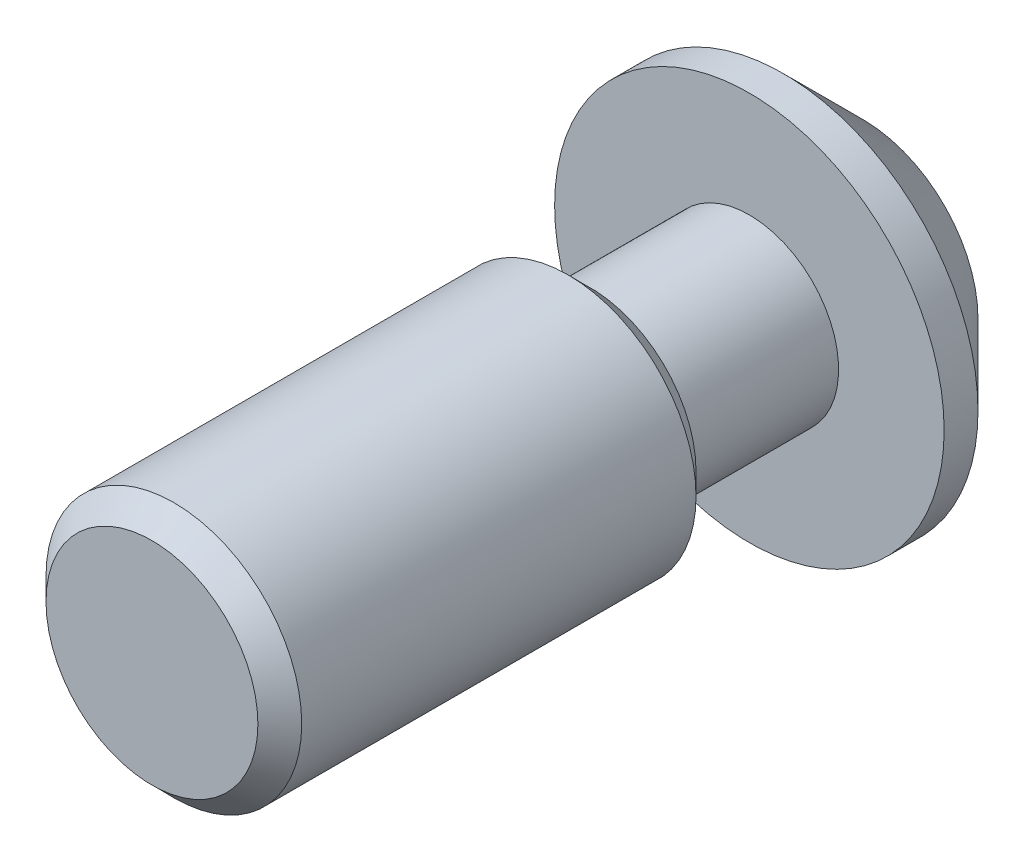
ISO-10303-21;
HEADER;
FILE_DESCRIPTION(('STEP AP214'),'2;1');
FILE_NAME('part.step','',(''),(''),'','','');
FILE_SCHEMA(('AUTOMOTIVE_DESIGN { 1 0 10303 214 1 1 1 1 }'));
ENDSEC;
DATA;
#1=APPLICATION_CONTEXT('core data for automotive mechanical design processes');
#2=APPLICATION_PROTOCOL_DEFINITION('international standard','automotive_design',2000,#1);
#3=PRODUCT_CONTEXT('',#1,'mechanical');
#4=PRODUCT('Part','Part','',(#3));
#5=PRODUCT_RELATED_PRODUCT_CATEGORY('part','',(#4));
#6=PRODUCT_DEFINITION_FORMATION('','',#4);
#7=PRODUCT_DEFINITION_CONTEXT('part definition',#1,'design');
#8=PRODUCT_DEFINITION('design','',#6,#7);
#9=PRODUCT_DEFINITION_SHAPE('','',#8);
#10=(LENGTH_UNIT() NAMED_UNIT(*) SI_UNIT(.MILLI.,.METRE.));
#11=(NAMED_UNIT(*) PLANE_ANGLE_UNIT() SI_UNIT($,.RADIAN.));
#12=(NAMED_UNIT(*) SI_UNIT($,.STERADIAN.) SOLID_ANGLE_UNIT());
#13=UNCERTAINTY_MEASURE_WITH_UNIT(LENGTH_MEASURE(1.E-05),#10,'distance_accuracy_value','');
#14=(GEOMETRIC_REPRESENTATION_CONTEXT(3) GLOBAL_UNCERTAINTY_ASSIGNED_CONTEXT((#13)) GLOBAL_UNIT_ASSIGNED_CONTEXT((#10,
#11,#12)) REPRESENTATION_CONTEXT('',''));
#15=CARTESIAN_POINT('',(0.,0.,0.));
#16=DIRECTION('',(0.,0.,1.));
#17=DIRECTION('',(1.,0.,0.));
#18=AXIS2_PLACEMENT_3D('',#15,#16,#17);
#19=CARTESIAN_POINT('',(0.,-2.88997909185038,-11.6999999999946));
#20=DIRECTION('',(0.,0.,-1.));
#21=DIRECTION('',(-1.,0.,0.));
#22=AXIS2_PLACEMENT_3D('',#19,#20,#21);
#23=PLANE('',#22);
#24=CARTESIAN_POINT('',(0.,0.,-11.7000000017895));
#25=DIRECTION('',(0.,0.,1.));
#26=DIRECTION('',(1.,0.,0.));
#27=AXIS2_PLACEMENT_3D('',#24,#25,#26);
#28=CIRCLE('',#27,5.77995818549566);
#29=CARTESIAN_POINT('',(5.77995818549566,0.,-11.7000000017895));
#30=VERTEX_POINT('',#29);
#31=EDGE_CURVE('E16',#30,#30,#28,.T.);
#32=ORIENTED_EDGE('',*,*,#31,.F.);
#33=EDGE_LOOP('',(#32));
#34=FACE_BOUND('',#33,.T.);
#35=ADVANCED_FACE('F13',(#34),#23,.T.);
#36=CARTESIAN_POINT('',(0.,0.,-7.69999999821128));
#37=DIRECTION('',(0.,0.,1.));
#38=DIRECTION('',(1.,0.,0.));
#39=AXIS2_PLACEMENT_3D('',#36,#37,#38);
#40=CONICAL_SURFACE('',#39,9.77995818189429,0.785398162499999);
#41=CARTESIAN_POINT('',(0.,0.,-7.70000000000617));
#42=DIRECTION('',(0.,0.,-1.));
#43=DIRECTION('',(-1.,0.,0.));
#44=AXIS2_PLACEMENT_3D('',#41,#42,#43);
#45=CIRCLE('',#44,9.77995818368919);
#46=CARTESIAN_POINT('',(-9.77995818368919,0.,-7.70000000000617));
#47=VERTEX_POINT('',#46);
#48=EDGE_CURVE('E28',#47,#47,#45,.F.);
#49=ORIENTED_EDGE('',*,*,#48,.F.);
#50=EDGE_LOOP('',(#49));
#51=FACE_BOUND('',#50,.T.);
#52=ORIENTED_EDGE('',*,*,#31,.T.);
#53=EDGE_LOOP('',(#52));
#54=FACE_BOUND('',#53,.T.);
#55=ADVANCED_FACE('F50',(#51,#54),#40,.T.);
#56=CARTESIAN_POINT('',(0.,0.,-6.85000000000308));
#57=DIRECTION('',(0.,0.,-1.));
#58=DIRECTION('',(-1.,0.,0.));
#59=AXIS2_PLACEMENT_3D('',#56,#57,#58);
#60=CYLINDRICAL_SURFACE('',#59,9.77995818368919);
#61=CARTESIAN_POINT('',(0.,0.,-6.));
#62=DIRECTION('',(0.,0.,-1.));
#63=DIRECTION('',(-1.,0.,0.));
#64=AXIS2_PLACEMENT_3D('',#61,#62,#63);
#65=CIRCLE('',#64,9.77995818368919);
#66=CARTESIAN_POINT('',(-9.77995818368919,0.,-6.));
#67=VERTEX_POINT('',#66);
#68=EDGE_CURVE('E31',#67,#67,#65,.F.);
#69=ORIENTED_EDGE('',*,*,#68,.F.);
#70=EDGE_LOOP('',(#69));
#71=FACE_BOUND('',#70,.T.);
#72=ORIENTED_EDGE('',*,*,#48,.T.);
#73=EDGE_LOOP('',(#72));
#74=FACE_BOUND('',#73,.T.);
#75=ADVANCED_FACE('F47',(#71,#74),#60,.T.);
#76=CARTESIAN_POINT('',(0.,-7.12992059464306,-6.00000000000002));
#77=DIRECTION('',(0.,0.,1.));
#78=DIRECTION('',(1.,0.,0.));
#79=AXIS2_PLACEMENT_3D('',#76,#77,#78);
#80=PLANE('',#79);
#81=CARTESIAN_POINT('',(0.,0.,-6.00000000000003));
#82=DIRECTION('',(0.,0.,-1.));
#83=DIRECTION('',(-1.,0.,0.));
#84=AXIS2_PLACEMENT_3D('',#81,#82,#83);
#85=CIRCLE('',#84,4.47988300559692);
#86=CARTESIAN_POINT('',(-4.47988300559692,0.,-6.00000000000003));
#87=VERTEX_POINT('',#86);
#88=EDGE_CURVE('E40',#87,#87,#85,.F.);
#89=ORIENTED_EDGE('',*,*,#88,.F.);
#90=EDGE_LOOP('',(#89));
#91=FACE_BOUND('',#90,.T.);
#92=ORIENTED_EDGE('',*,*,#68,.T.);
#93=EDGE_LOOP('',(#92));
#94=FACE_BOUND('',#93,.T.);
#95=ADVANCED_FACE('F45',(#91,#94),#80,.T.);
#96=CARTESIAN_POINT('',(0.,0.,-2.00000000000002));
#97=DIRECTION('',(0.,0.,-1.));
#98=DIRECTION('',(-1.,0.,0.));
#99=AXIS2_PLACEMENT_3D('',#96,#97,#98);
#100=CYLINDRICAL_SURFACE('',#99,4.47988300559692);
#101=CARTESIAN_POINT('',(0.,0.,1.99999999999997));
#102=DIRECTION('',(0.,0.,-1.));
#103=DIRECTION('',(-1.,0.,0.));
#104=AXIS2_PLACEMENT_3D('',#101,#102,#103);
#105=CIRCLE('',#104,4.47988300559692);
#106=CARTESIAN_POINT('',(-4.47988300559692,0.,1.99999999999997));
#107=VERTEX_POINT('',#106);
#108=EDGE_CURVE('E37',#107,#107,#105,.F.);
#109=ORIENTED_EDGE('',*,*,#108,.F.);
#110=EDGE_LOOP('',(#109));
#111=FACE_BOUND('',#110,.T.);
#112=ORIENTED_EDGE('',*,*,#88,.T.);
#113=EDGE_LOOP('',(#112));
#114=FACE_BOUND('',#113,.T.);
#115=ADVANCED_FACE('F85',(#111,#114),#100,.T.);
#116=CARTESIAN_POINT('',(0.,-4.89999999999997,1.99999999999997));
#117=DIRECTION('',(0.,0.,-1.));
#118=DIRECTION('',(-1.,0.,0.));
#119=AXIS2_PLACEMENT_3D('',#116,#117,#118);
#120=PLANE('',#119);
#121=ORIENTED_EDGE('',*,*,#108,.T.);
#122=EDGE_LOOP('',(#121));
#123=FACE_BOUND('',#122,.T.);
#124=CARTESIAN_POINT('',(0.,0.,1.99999999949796));
#125=DIRECTION('',(0.,0.,1.));
#126=DIRECTION('',(1.,0.,0.));
#127=AXIS2_PLACEMENT_3D('',#124,#125,#126);
#128=CIRCLE('',#127,5.32011699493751);
#129=CARTESIAN_POINT('',(5.32011699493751,0.,1.99999999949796));
#130=VERTEX_POINT('',#129);
#131=EDGE_CURVE('E34',#130,#130,#128,.T.);
#132=ORIENTED_EDGE('',*,*,#131,.F.);
#133=EDGE_LOOP('',(#132));
#134=FACE_BOUND('',#133,.T.);
#135=ADVANCED_FACE('F81',(#123,#134),#120,.T.);
#136=CARTESIAN_POINT('',(0.,-2.66005849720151,24.));
#137=DIRECTION('',(0.,0.,1.));
#138=DIRECTION('',(1.,0.,0.));
#139=AXIS2_PLACEMENT_3D('',#136,#137,#138);
#140=PLANE('',#139);
#141=CARTESIAN_POINT('',(0.,0.,24.0000000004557));
#142=DIRECTION('',(0.,0.,-1.));
#143=DIRECTION('',(-1.,0.,0.));
#144=AXIS2_PLACEMENT_3D('',#141,#142,#143);
#145=CIRCLE('',#144,5.32011699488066);
#146=CARTESIAN_POINT('',(-5.32011699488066,0.,24.0000000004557));
#147=VERTEX_POINT('',#146);
#148=EDGE_CURVE('E25',#147,#147,#145,.T.);
#149=ORIENTED_EDGE('',*,*,#148,.F.);
#150=EDGE_LOOP('',(#149));
#151=FACE_BOUND('',#150,.T.);
#152=ADVANCED_FACE('F77',(#151),#140,.T.);
#153=CARTESIAN_POINT('',(0.,0.,3.10000000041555));
#154=DIRECTION('',(0.,0.,1.));
#155=DIRECTION('',(1.,0.,0.));
#156=AXIS2_PLACEMENT_3D('',#153,#154,#155);
#157=CONICAL_SURFACE('',#156,6.42011699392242,0.785398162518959);
#158=ORIENTED_EDGE('',*,*,#131,.T.);
#159=EDGE_LOOP('',(#158));
#160=FACE_BOUND('',#159,.T.);
#161=CARTESIAN_POINT('',(0.,0.,3.09999999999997));
#162=DIRECTION('',(0.,0.,-1.));
#163=DIRECTION('',(-1.,0.,0.));
#164=AXIS2_PLACEMENT_3D('',#161,#162,#163);
#165=CIRCLE('',#164,6.42011699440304);
#166=CARTESIAN_POINT('',(-6.42011699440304,0.,3.09999999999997));
#167=VERTEX_POINT('',#166);
#168=EDGE_CURVE('E20',#167,#167,#165,.F.);
#169=ORIENTED_EDGE('',*,*,#168,.F.);
#170=EDGE_LOOP('',(#169));
#171=FACE_BOUND('',#170,.T.);
#172=ADVANCED_FACE('F71',(#160,#171),#157,.T.);
#173=CARTESIAN_POINT('',(0.,0.,22.8999999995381));
#174=DIRECTION('',(0.,0.,-1.));
#175=DIRECTION('',(-1.,0.,0.));
#176=AXIS2_PLACEMENT_3D('',#173,#174,#175);
#177=CONICAL_SURFACE('',#176,6.42011699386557,0.785398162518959);
#178=ORIENTED_EDGE('',*,*,#148,.T.);
#179=EDGE_LOOP('',(#178));
#180=FACE_BOUND('',#179,.T.);
#181=CARTESIAN_POINT('',(0.,0.,22.9));
#182=DIRECTION('',(0.,0.,-1.));
#183=DIRECTION('',(-1.,0.,0.));
#184=AXIS2_PLACEMENT_3D('',#181,#182,#183);
#185=CIRCLE('',#184,6.42011699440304);
#186=CARTESIAN_POINT('',(-6.42011699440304,0.,22.9));
#187=VERTEX_POINT('',#186);
#188=EDGE_CURVE('E9',#187,#187,#185,.T.);
#189=ORIENTED_EDGE('',*,*,#188,.F.);
#190=EDGE_LOOP('',(#189));
#191=FACE_BOUND('',#190,.T.);
#192=ADVANCED_FACE('F65',(#180,#191),#177,.T.);
#193=CARTESIAN_POINT('',(0.,0.,13.));
#194=DIRECTION('',(0.,0.,-1.));
#195=DIRECTION('',(-1.,0.,0.));
#196=AXIS2_PLACEMENT_3D('',#193,#194,#195);
#197=CYLINDRICAL_SURFACE('',#196,6.42011699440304);
#198=ORIENTED_EDGE('',*,*,#168,.T.);
#199=EDGE_LOOP('',(#198));
#200=FACE_BOUND('',#199,.T.);
#201=ORIENTED_EDGE('',*,*,#188,.T.);
#202=EDGE_LOOP('',(#201));
#203=FACE_BOUND('',#202,.T.);
#204=ADVANCED_FACE('F63',(#200,#203),#197,.T.);
#205=CLOSED_SHELL('',(#35,#55,#75,#95,#115,#135,#152,#172,#192,#204));
#206=MANIFOLD_SOLID_BREP('B1',#205);
#207=ADVANCED_BREP_SHAPE_REPRESENTATION('',(#18,#206),#14);
#208=SHAPE_DEFINITION_REPRESENTATION(#9,#207);
ENDSEC;
END-ISO-10303-21;
